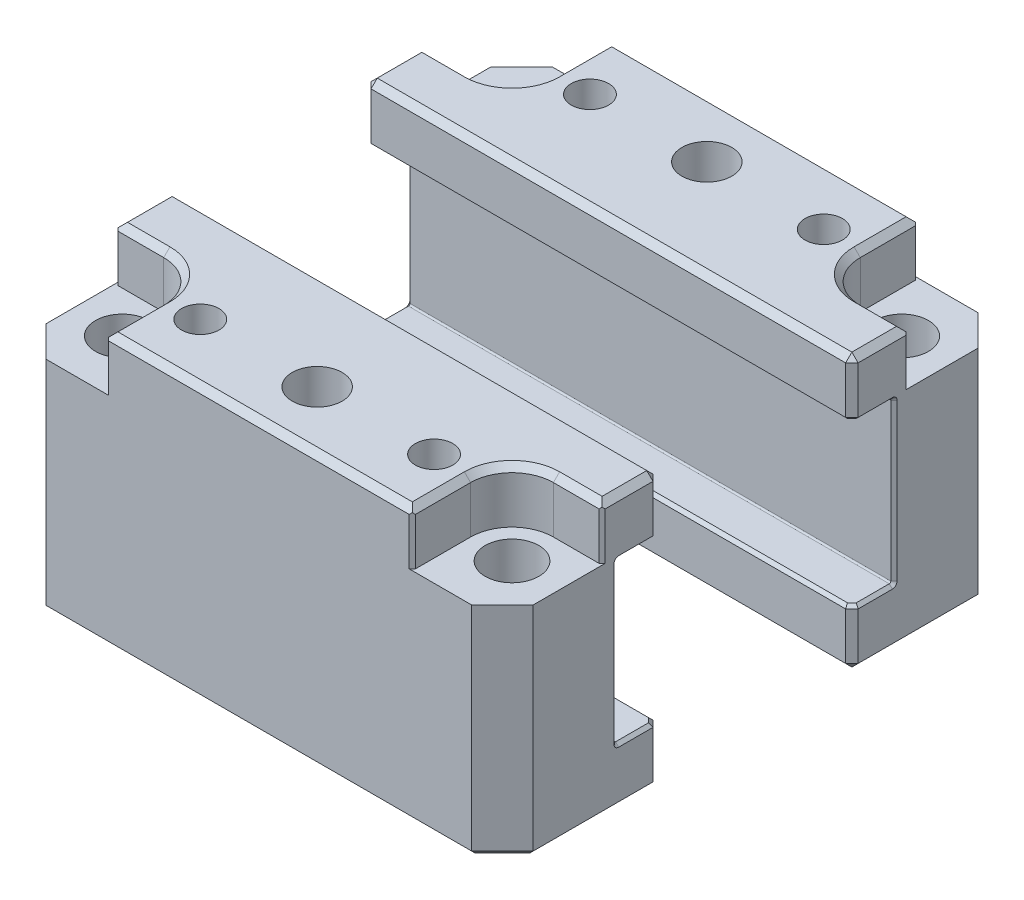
from build123d import *

# Parameters (mm, degrees)
SKETCH1_W                                         = 25.5524
SKETCH1_H                                         = 44.45
BOSS_EXTRUDE1_DEPTH                               = 39.6875
CBORE_FOR_5_16_SOCKET_HEAD_CAP_SCREW1_D           = 8.72998
CBORE_FOR_5_16_SOCKET_HEAD_CAP_SCREW1_CBORE_D     = 13.49502
CBORE_FOR_5_16_SOCKET_HEAD_CAP_SCREW1_CBORE_DEPTH = 8.6995
F_3_8_16_TAPPED_HOLE5_D                           = 8.128
F_3_8_16_TAPPED_HOLE5_DEPTH                       = 27.94
F_3_8_16_TAPPED_HOLE5_TIP                         = 2.441897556
CHAMFER1_SIZE                                     = 5
CUT_EXTRUDE3_DEPTH                                = 8.6995
SKETCH9_W                                         = 79.375
SKETCH9_H                                         = 26.0096
CUT_EXTRUDE4_DEPTH                                = 6.858
F_3_8_16_TAPPED_HOLE4_D                           = 8.7376
FILLET1_R                                         = 0.254
CHAMFER2_SIZE                                     = 1.016
CHAMFER3_SIZE                                     = 0.508
CHAMFER4_SIZE                                     = 0.508
CHAMFER5_SIZE                                     = 0.508


with BuildPart() as part:
    # Sketch1 → Boss-Extrude1 (new, symmetric)
    with BuildSketch(Plane(origin=(0, 0, 0), x_dir=(0, 0, -1), z_dir=(1, 0, 0))):
        with Locations((-28.4734, 22.225)):
            Rectangle(SKETCH1_W, SKETCH1_H)
    extrude(amount=BOSS_EXTRUDE1_DEPTH, both=True)

    # CBORE for 5_16 Socket Head Cap Screw1 (through all)
    with Locations(Plane(origin=(0, 44.45, 0), x_dir=(1, 0, 0), z_dir=(0, 1, 0))):
        with Locations((-31.75, -31.75), (31.75, -31.75)):
            CounterBoreHole(CBORE_FOR_5_16_SOCKET_HEAD_CAP_SCREW1_D / 2, CBORE_FOR_5_16_SOCKET_HEAD_CAP_SCREW1_CBORE_D / 2, CBORE_FOR_5_16_SOCKET_HEAD_CAP_SCREW1_CBORE_DEPTH)

    # 3_8-16 Tapped Hole5
    with Locations(Plane(origin=(0, 44.45, 0), x_dir=(1, 0, 0), z_dir=(0, 1, 0))):
        with Locations((0, -31.75)):
            Hole(F_3_8_16_TAPPED_HOLE5_D / 2, depth=F_3_8_16_TAPPED_HOLE5_DEPTH)
            with Locations((0, 0, -(F_3_8_16_TAPPED_HOLE5_DEPTH + F_3_8_16_TAPPED_HOLE5_TIP / 2))):  # 118° drill point
                Cone(0, F_3_8_16_TAPPED_HOLE5_D / 2, F_3_8_16_TAPPED_HOLE5_TIP, mode=Mode.SUBTRACT)

    # Chamfer1
    chamfer1_edges = [part.edges().sort_by_distance(p)[0] for p in [
        (39.6875, 22.225, 41.2496),
        (-39.6875, 22.225, 41.2496),
    ]]
    chamfer(chamfer1_edges, length=CHAMFER1_SIZE)

    # Sketch19 → Cut-Revolve1 (revolve, cut)
    with BuildSketch(Plane.XY.offset(31.75)):
        Polygon((-22.098, 44.45), (-22.098, 12.776309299), (-22.225, 12.7), (-22.225, 0), (-19.05, 0), (-19.05, 44.45), align=None)
    cut_revolve1 = revolve(axis=Axis((-19.05, 51.232562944, 31.75), (0, -1, 0)), mode=Mode.SUBTRACT)

    # Mirror1: Cut-Revolve1 across plane
    add(cut_revolve1.mirror(Plane(origin=(0, 0, 0), x_dir=(0, 0, 1), z_dir=(1, 0, 0))), mode=Mode.SUBTRACT)

    # Sketch8 → Cut-Extrude3 (cut)
    with BuildSketch(Plane(origin=(0, 44.45, 0), x_dir=(1, 0, 0), z_dir=(0, 1, 0))):
        with BuildLine():
            Line((-31.75, -25.00249), (-39.6875, -25.00249))
            Line((-39.6875, -25.00249), (-39.6875, -41.2496))
            Line((-39.6875, -41.2496), (-25.00249, -41.2496))
            Line((-25.00249, -41.2496), (-25.00249, -31.75))
            ThreePointArc((-25.00249, -31.75), (-26.978789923, -26.978789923), (-31.75, -25.00249))
        make_face()
        with BuildLine():
            Line((25.00249, -41.2496), (25.00249, -31.75))
            ThreePointArc((25.00249, -31.75), (26.978789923, -26.978789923), (31.75, -25.00249))
            Line((31.75, -25.00249), (39.6875, -25.00249))
            Line((39.6875, -25.00249), (39.6875, -41.2496))
            Line((39.6875, -41.2496), (25.00249, -41.2496))
        make_face()
    extrude(amount=-CUT_EXTRUDE3_DEPTH, mode=Mode.SUBTRACT)

    # Sketch9 → Cut-Extrude4 (cut)
    with BuildSketch(Plane(origin=(0, 0, 15.6972), x_dir=(-1, 0, 0), z_dir=(0, 0, -1))):
        with Locations((0, 22.225)):
            Rectangle(SKETCH9_W, SKETCH9_H)
    extrude(amount=-CUT_EXTRUDE4_DEPTH, mode=Mode.SUBTRACT)

    # 3_8-16 Tapped Hole4 (through all)
    with Locations(Plane(origin=(0, 0, 0), x_dir=(-1, 0, 0), z_dir=(0, -1, 0))):
        with Locations((31.75, -31.75), (-31.75, -31.75)):
            Hole(F_3_8_16_TAPPED_HOLE4_D / 2)

    # Fillet1
    fillet1_edges = [part.edges().sort_by_distance(p)[0] for p in [
        (0, 35.2298, 22.5552),
        (0, 9.2202, 22.5552),
    ]]
    fillet(fillet1_edges, radius=FILLET1_R)

    # Chamfer2
    chamfer2_edges = [part.edges().sort_by_distance(p)[0] for p in [
        (39.6875, 44.45, 20.349845),
        (-39.6875, 39.8399, 15.6972),
        (39.6875, 39.8399, 15.6972),
        (26.978789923, 44.45, 26.978789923),
        (-26.978789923, 44.45, 26.978789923),
        (39.6875, 0, 25.9734),
        (-39.6875, 0, 25.9734),
        (0, 0, 41.2496),
        (-37.1875, 0, 38.7496),
        (37.1875, 0, 38.7496),
        (-39.6875, 44.45, 20.349845),
        (-39.6875, 4.6101, 15.6972),
        (-25.00249, 44.45, 36.4998),
        (-35.71875, 44.45, 25.00249),
        (39.6875, 4.6101, 15.6972),
        (0, 44.45, 15.6972),
        (0, 0, 15.6972),
        (0, 44.45, 41.2496),
        (25.00249, 44.45, 36.4998),
        (35.71875, 44.45, 25.00249),
    ]]
    chamfer(chamfer2_edges, length=CHAMFER2_SIZE)

    # Chamfer3
    chamfer3_edges = [part.edges().sort_by_distance(p)[0] for p in [
        (-39.6875, 39.59225, 25.00249),
        (-25.00249, 39.59225, 41.2496),
        (25.00249, 39.59225, 41.2496),
        (39.6875, 39.59225, 25.00249),
    ]]
    chamfer(chamfer3_edges, length=CHAMFER3_SIZE)

    # Chamfer4
    chamfer4_edges = [part.edges().sort_by_distance(p)[0] for p in [
        (-39.6875, 22.225, 22.5552),
        (39.6875, 22.225, 22.5552),
        (39.6875, 9.2202, 19.5072),
        (-39.6875, 9.2202, 19.5072),
        (-39.6875, 35.2298, 19.5072),
        (39.6875, 35.2298, 19.5072),
        (-39.6875, 9.294594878, 22.480805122),
        (39.6875, 9.294594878, 22.480805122),
        (39.6875, 35.155405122, 22.480805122),
        (-39.6875, 35.155405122, 22.480805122),
        (0, 35.2298, 15.6972),
        (39.1795, 35.2298, 16.2052),
        (-39.1795, 35.2298, 16.2052),
        (0, 9.2202, 15.6972),
        (39.1795, 9.2202, 16.2052),
        (-39.1795, 9.2202, 16.2052),
    ]]
    chamfer(chamfer4_edges, length=CHAMFER4_SIZE)

    # Chamfer5
    chamfer5_edges = [part.edges().sort_by_distance(p)[0] for p in [
        (-15.875, 0, 31.75),
        (15.875, 0, 31.75),
    ]]
    chamfer(chamfer5_edges, length=CHAMFER5_SIZE)


with BuildPart() as body_2:
    # Mirror2: mirrored copy
    add(part.part.mirror(Plane.XY))


solid = Compound([part.part, body_2.part])
